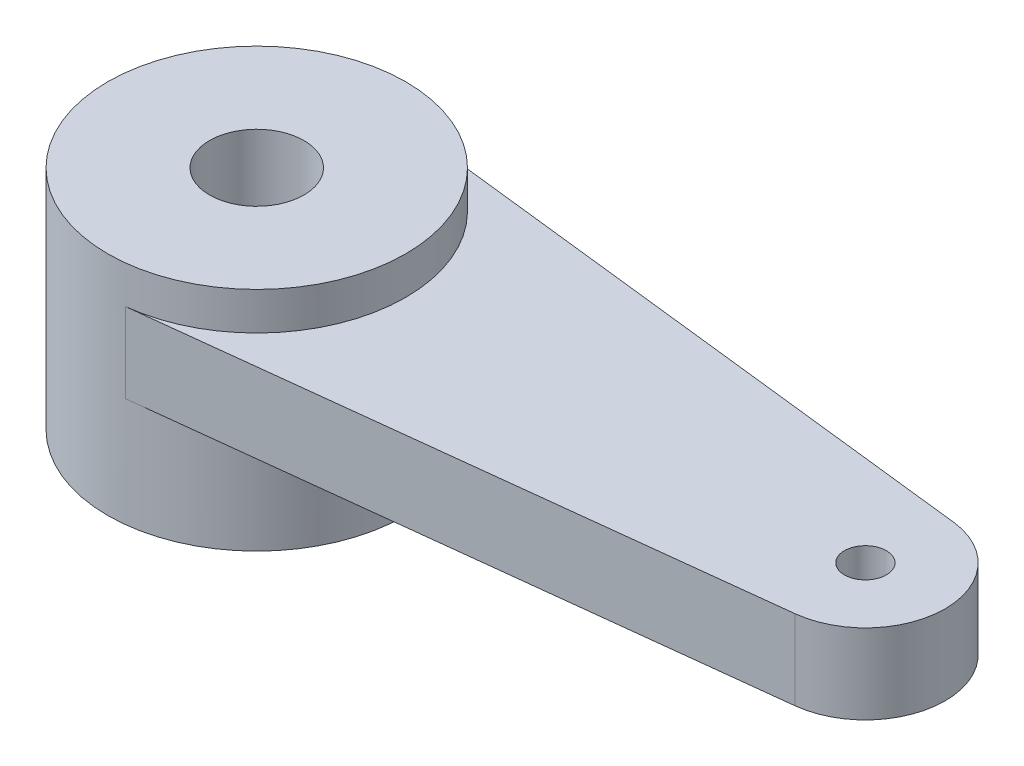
from build123d import *
from build123d.topology import SkipClean

# Parameters (mm, degrees)
ESQUISSE1_R             = 0.5
BOSS_EXTRU_1_DEPTH      = 1.9
ESQUISSE2_R             = 3.55
BOSS_EXTRU_2_DEPTH      = 0.9
BOSS_EXTRU_3_START      = 2.6
ESQUISSE3_R             = 3.55
BOSS_EXTRU_3_DEPTH      = 2.6
ESQUISSE4_R             = 2.4
ENL_V_MAT_EXTRU_1_DEPTH = 3.2
ESQUISSE5_R             = 1.125
ENL_V_MAT_EXTRU_2_DEPTH = 18.627322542


with BuildPart() as part:
    # Esquisse1 → Boss.-Extru.1 (new body)
    with BuildSketch(Plane(origin=(0, 0, 0), x_dir=(1, 0, 0), z_dir=(0, 1, 0))):
        with BuildLine():
            Line((0.403965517, 3.526940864), (14.716206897, 1.887658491))
            ThreePointArc((14.716206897, 1.887658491), (16.4, 0), (14.716206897, -1.887658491))
            Line((14.716206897, -1.887658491), (0.403965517, -3.526940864))
            ThreePointArc((0.403965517, -3.526940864), (-3.55, 0), (0.403965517, 3.526940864))
        make_face()
        with Locations(Location((14.5, 0, 0), (0, 0, 270))):
            Circle(ESQUISSE1_R, mode=Mode.SUBTRACT)
    extrude(amount=BOSS_EXTRU_1_DEPTH)

    # Esquisse2 → Boss.-Extru.2 (add)
    with SkipClean():  # the faces are left unmerged after this step: merging them gives an invalid solid
        with BuildSketch(Plane(origin=(0, 1.9, 0), x_dir=(1, 0, 0), z_dir=(0, 1, 0))):
            with Locations(Location((0, 0, 0), (0, 0, 83.465981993))):
                Circle(ESQUISSE2_R)
        extrude(amount=BOSS_EXTRU_2_DEPTH)

    # Esquisse3 → Boss.-Extru.3 (add)
    with SkipClean():  # the faces are left unmerged after this step: merging them gives an invalid solid
        with BuildSketch(Plane.XZ.offset(BOSS_EXTRU_3_START)):
            with Locations(Location((0, 0, 0), (0, 0, 90))):
                Circle(ESQUISSE3_R)
        extrude(amount=-BOSS_EXTRU_3_DEPTH)

    # Esquisse4 → Enl_v. mat.-Extru.1 (cut)
    with SkipClean():  # the faces are left unmerged after this step: merging them gives an invalid solid
        with BuildSketch(Plane.XZ.offset(2.6)):
            with Locations(Location((0, 0, 0), (0, 0, 270))):
                Circle(ESQUISSE4_R)
        extrude(amount=-ENL_V_MAT_EXTRU_1_DEPTH, mode=Mode.SUBTRACT)

    # Esquisse5 → Enl_v. mat.-Extru.2 (cut, through all)
    with SkipClean():  # the faces are left unmerged after this step: merging them gives an invalid solid
        with BuildSketch(Plane(origin=(0, 2.8, 0), x_dir=(1, 0, 0), z_dir=(0, 1, 0))):
            with Locations(Location((0, 0, 0), (0, 0, 270))):
                Circle(ESQUISSE5_R)
        extrude(amount=-ENL_V_MAT_EXTRU_2_DEPTH, mode=Mode.SUBTRACT)


solid = part.part
